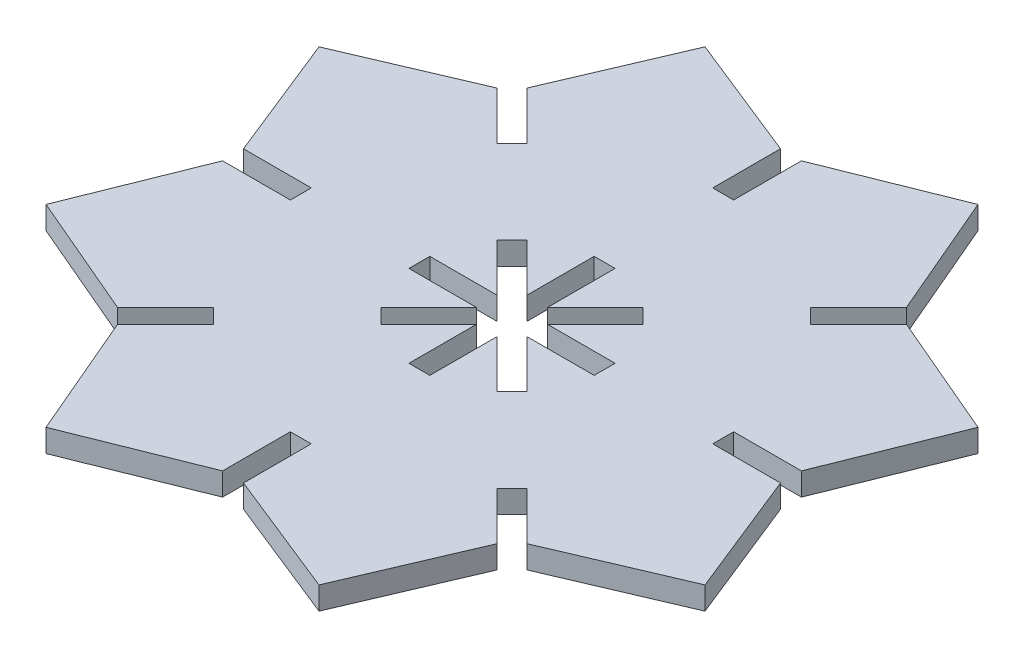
from build123d import *

# Parameters (mm, degrees)
CROQUIS1_R              = 39.9625
CROQUIS1_R_2            = 2.9625
SALIENTE_EXTRUIR1_DEPTH = 1.25
CORTAR_EXTRUIR2_DEPTH   = 57.570777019
MATRIZC1_COUNT          = 8


with BuildPart() as part:
    # Croquis1 → Saliente-Extruir1 (new, symmetric)
    with BuildSketch(Plane(origin=(0, 0, 0), x_dir=(1, 0, 0), z_dir=(0, 1, 0))):
        with Locations(Location((0, 0, 0), (0, 0, 270))):
            Circle(CROQUIS1_R)
        with Locations(Location((0, 0, 0), (0, 0, 270))):
            Circle(CROQUIS1_R_2, mode=Mode.SUBTRACT)
    extrude(amount=SALIENTE_EXTRUIR1_DEPTH, both=True)

    # Croquis2 → Cortar-Extruir2 (cut, symmetric)
    with BuildSketch(Plane(origin=(0, 1.25, 0), x_dir=(1, 0, 0), z_dir=(0, 1, 0))):
        Polygon((-29.082429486, 103.211352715), (29.082429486, 103.211352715), (29.082429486, 27.408277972), (16, 36.619686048), (1.15, 30.663386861), (1.15, 23.211352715), (-1.15, 23.211352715), (-1.15, 30.663386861), (-16, 36.619686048), (-29.082429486, 27.408277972), align=None)
        with BuildLine():
            Line((-1.15, 2.730184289), (-1.15, 10.182218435))
            Line((-1.15, 10.182218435), (1.15, 10.182218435))
            Line((1.15, 10.182218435), (1.15, 2.730184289))
            ThreePointArc((1.15, 2.730184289), (0, 2.9625), (-1.15, 2.730184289))
        make_face()
    cortar_extruir2 = extrude(amount=CORTAR_EXTRUIR2_DEPTH, both=True, mode=Mode.SUBTRACT)

    # MatrizC1: Cortar-Extruir2 ×8 about axis
    matrizc1_axis = Axis((0, 0, 0), (0, 1, 0))
    for i in range(1, MATRIZC1_COUNT):
        add(cortar_extruir2.rotate(matrizc1_axis, i * 360 / MATRIZC1_COUNT), mode=Mode.SUBTRACT)


solid = part.part
